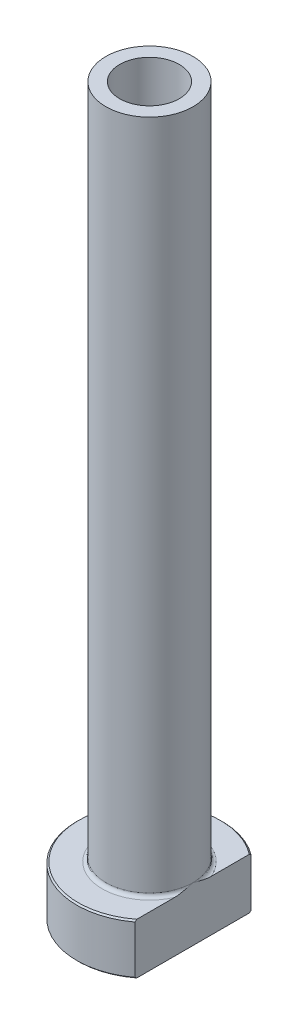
ISO-10303-21;
HEADER;
FILE_DESCRIPTION(('STEP AP214'),'2;1');
FILE_NAME('part.step','',(''),(''),'','','');
FILE_SCHEMA(('AUTOMOTIVE_DESIGN { 1 0 10303 214 1 1 1 1 }'));
ENDSEC;
DATA;
#1=APPLICATION_CONTEXT('core data for automotive mechanical design processes');
#2=APPLICATION_PROTOCOL_DEFINITION('international standard','automotive_design',2000,#1);
#3=PRODUCT_CONTEXT('',#1,'mechanical');
#4=PRODUCT('Part','Part','',(#3));
#5=PRODUCT_RELATED_PRODUCT_CATEGORY('part','',(#4));
#6=PRODUCT_DEFINITION_FORMATION('','',#4);
#7=PRODUCT_DEFINITION_CONTEXT('part definition',#1,'design');
#8=PRODUCT_DEFINITION('design','',#6,#7);
#9=PRODUCT_DEFINITION_SHAPE('','',#8);
#10=(LENGTH_UNIT() NAMED_UNIT(*) SI_UNIT(.MILLI.,.METRE.));
#11=(NAMED_UNIT(*) PLANE_ANGLE_UNIT() SI_UNIT($,.RADIAN.));
#12=(NAMED_UNIT(*) SI_UNIT($,.STERADIAN.) SOLID_ANGLE_UNIT());
#13=UNCERTAINTY_MEASURE_WITH_UNIT(LENGTH_MEASURE(1.E-05),#10,'distance_accuracy_value','');
#14=(GEOMETRIC_REPRESENTATION_CONTEXT(3) GLOBAL_UNCERTAINTY_ASSIGNED_CONTEXT((#13)) GLOBAL_UNIT_ASSIGNED_CONTEXT((#10,
#11,#12)) REPRESENTATION_CONTEXT('',''));
#15=CARTESIAN_POINT('',(0.,0.,0.));
#16=DIRECTION('',(0.,0.,1.));
#17=DIRECTION('',(1.,0.,0.));
#18=AXIS2_PLACEMENT_3D('',#15,#16,#17);
#19=CARTESIAN_POINT('',(0.,92.1876809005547,0.));
#20=DIRECTION('',(0.,1.,0.));
#21=DIRECTION('',(0.,0.,1.));
#22=AXIS2_PLACEMENT_3D('',#19,#20,#21);
#23=CYLINDRICAL_SURFACE('',#22,4.09999999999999);
#24=CARTESIAN_POINT('',(0.,100.,0.));
#25=DIRECTION('',(0.,1.,0.));
#26=DIRECTION('',(0.,0.,1.));
#27=AXIS2_PLACEMENT_3D('',#24,#25,#26);
#28=CIRCLE('',#27,4.09999999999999);
#29=CARTESIAN_POINT('',(0.,100.,4.09999999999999));
#30=VERTEX_POINT('',#29);
#31=EDGE_CURVE('E167',#30,#30,#28,.T.);
#32=ORIENTED_EDGE('',*,*,#31,.T.);
#33=EDGE_LOOP('',(#32));
#34=FACE_BOUND('',#33,.T.);
#35=CARTESIAN_POINT('',(0.,55.,0.));
#36=DIRECTION('',(0.,1.,0.));
#37=DIRECTION('',(0.,0.,1.));
#38=AXIS2_PLACEMENT_3D('',#35,#36,#37);
#39=CIRCLE('',#38,4.09999999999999);
#40=CARTESIAN_POINT('',(0.,55.,4.09999999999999));
#41=VERTEX_POINT('',#40);
#42=EDGE_CURVE('E170',#41,#41,#39,.T.);
#43=ORIENTED_EDGE('',*,*,#42,.F.);
#44=EDGE_LOOP('',(#43));
#45=FACE_BOUND('',#44,.T.);
#46=ADVANCED_FACE('F32',(#34,#45),#23,.F.);
#47=CARTESIAN_POINT('',(-4.09999999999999,100.,0.));
#48=DIRECTION('',(0.,1.,0.));
#49=DIRECTION('',(0.,0.,1.));
#50=AXIS2_PLACEMENT_3D('',#47,#48,#49);
#51=PLANE('',#50);
#52=CARTESIAN_POINT('',(0.,100.,0.));
#53=DIRECTION('',(0.,1.,0.));
#54=DIRECTION('',(0.,0.,1.));
#55=AXIS2_PLACEMENT_3D('',#52,#53,#54);
#56=CIRCLE('',#55,6.);
#57=CARTESIAN_POINT('',(0.,100.,6.));
#58=VERTEX_POINT('',#57);
#59=EDGE_CURVE('E174',#58,#58,#56,.T.);
#60=ORIENTED_EDGE('',*,*,#59,.T.);
#61=EDGE_LOOP('',(#60));
#62=FACE_BOUND('',#61,.T.);
#63=ORIENTED_EDGE('',*,*,#31,.F.);
#64=EDGE_LOOP('',(#63));
#65=FACE_BOUND('',#64,.T.);
#66=ADVANCED_FACE('F157',(#62,#65),#51,.T.);
#67=CARTESIAN_POINT('',(0.,92.1876809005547,0.));
#68=DIRECTION('',(0.,1.,0.));
#69=DIRECTION('',(0.,0.,1.));
#70=AXIS2_PLACEMENT_3D('',#67,#68,#69);
#71=CYLINDRICAL_SURFACE('',#70,6.);
#72=CARTESIAN_POINT('',(0.,7.50000000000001,0.));
#73=DIRECTION('',(0.,1.,0.));
#74=DIRECTION('',(0.,0.,1.));
#75=AXIS2_PLACEMENT_3D('',#72,#73,#74);
#76=CIRCLE('',#75,6.);
#77=CARTESIAN_POINT('',(6.,7.50000000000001,0.));
#78=VERTEX_POINT('',#77);
#79=EDGE_CURVE('E180',#78,#78,#76,.T.);
#80=ORIENTED_EDGE('',*,*,#79,.T.);
#81=EDGE_LOOP('',(#80));
#82=FACE_BOUND('',#81,.T.);
#83=ORIENTED_EDGE('',*,*,#59,.F.);
#84=EDGE_LOOP('',(#83));
#85=FACE_BOUND('',#84,.T.);
#86=ADVANCED_FACE('F162',(#82,#85),#71,.T.);
#87=CARTESIAN_POINT('',(-5.99999999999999,7.,0.));
#88=DIRECTION('',(0.,1.,0.));
#89=DIRECTION('',(0.,0.,1.));
#90=AXIS2_PLACEMENT_3D('',#87,#88,#89);
#91=PLANE('',#90);
#92=DIRECTION('',(0.,0.,1.));
#93=VECTOR('',#92,1.);
#94=CARTESIAN_POINT('',(6.,7.,0.));
#95=LINE('',#94,#93);
#96=CARTESIAN_POINT('',(6.,7.,-7.7485482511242));
#97=VERTEX_POINT('',#96);
#98=CARTESIAN_POINT('',(6.,7.,-2.5));
#99=VERTEX_POINT('',#98);
#100=EDGE_CURVE('E54',#97,#99,#95,.T.);
#101=ORIENTED_EDGE('',*,*,#100,.F.);
#102=CARTESIAN_POINT('',(0.,7.,0.));
#103=DIRECTION('',(0.,1.,0.));
#104=DIRECTION('',(0.,0.,1.));
#105=AXIS2_PLACEMENT_3D('',#102,#103,#104);
#106=CIRCLE('',#105,9.79999999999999);
#107=CARTESIAN_POINT('',(5.99999999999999,7.,7.7485482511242));
#108=VERTEX_POINT('',#107);
#109=EDGE_CURVE('E186',#97,#108,#106,.T.);
#110=ORIENTED_EDGE('',*,*,#109,.T.);
#111=CARTESIAN_POINT('',(6.,7.,2.5));
#112=VERTEX_POINT('',#111);
#113=EDGE_CURVE('E134',#112,#108,#95,.T.);
#114=ORIENTED_EDGE('',*,*,#113,.F.);
#115=CARTESIAN_POINT('',(0.,7.,0.));
#116=DIRECTION('',(0.,1.,0.));
#117=DIRECTION('',(0.,0.,1.));
#118=AXIS2_PLACEMENT_3D('',#115,#116,#117);
#119=CIRCLE('',#118,6.5);
#120=EDGE_CURVE('E183',#112,#99,#119,.F.);
#121=ORIENTED_EDGE('',*,*,#120,.T.);
#122=EDGE_LOOP('',(#101,#110,#114,#121));
#123=FACE_BOUND('',#122,.T.);
#124=ADVANCED_FACE('F197',(#123),#91,.T.);
#125=CARTESIAN_POINT('',(0.,92.1876809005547,0.));
#126=DIRECTION('',(0.,1.,0.));
#127=DIRECTION('',(0.,0.,1.));
#128=AXIS2_PLACEMENT_3D('',#125,#126,#127);
#129=CYLINDRICAL_SURFACE('',#128,9.99999999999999);
#130=DIRECTION('',(0.,-1.,0.));
#131=VECTOR('',#130,1.);
#132=CARTESIAN_POINT('',(5.99999999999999,100.,7.99999999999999));
#133=LINE('',#132,#131);
#134=CARTESIAN_POINT('',(5.99999999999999,6.8,7.99999999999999));
#135=VERTEX_POINT('',#134);
#136=CARTESIAN_POINT('',(5.99999999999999,0.199999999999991,7.99999999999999));
#137=VERTEX_POINT('',#136);
#138=EDGE_CURVE('E82',#135,#137,#133,.T.);
#139=ORIENTED_EDGE('',*,*,#138,.F.);
#140=CARTESIAN_POINT('',(0.,6.8,0.));
#141=DIRECTION('',(0.,1.,0.));
#142=DIRECTION('',(0.,0.,1.));
#143=AXIS2_PLACEMENT_3D('',#140,#141,#142);
#144=CIRCLE('',#143,9.99999999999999);
#145=CARTESIAN_POINT('',(6.,6.8,-7.99999999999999));
#146=VERTEX_POINT('',#145);
#147=EDGE_CURVE('E95',#135,#146,#144,.F.);
#148=ORIENTED_EDGE('',*,*,#147,.T.);
#149=DIRECTION('',(0.,-1.,0.));
#150=VECTOR('',#149,1.);
#151=CARTESIAN_POINT('',(6.,100.,-7.99999999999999));
#152=LINE('',#151,#150);
#153=CARTESIAN_POINT('',(6.,0.199999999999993,-7.99999999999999));
#154=VERTEX_POINT('',#153);
#155=EDGE_CURVE('E192',#146,#154,#152,.T.);
#156=ORIENTED_EDGE('',*,*,#155,.T.);
#157=CARTESIAN_POINT('',(0.,0.199999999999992,0.));
#158=DIRECTION('',(0.,-1.,0.));
#159=DIRECTION('',(0.,0.,-1.));
#160=AXIS2_PLACEMENT_3D('',#157,#158,#159);
#161=CIRCLE('',#160,9.99999999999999);
#162=EDGE_CURVE('E98',#154,#137,#161,.F.);
#163=ORIENTED_EDGE('',*,*,#162,.T.);
#164=EDGE_LOOP('',(#139,#148,#156,#163));
#165=FACE_BOUND('',#164,.T.);
#166=ADVANCED_FACE('F190',(#165),#129,.T.);
#167=CARTESIAN_POINT('',(-9.99999999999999,0.,0.));
#168=DIRECTION('',(0.,-1.,0.));
#169=DIRECTION('',(0.,0.,-1.));
#170=AXIS2_PLACEMENT_3D('',#167,#168,#169);
#171=PLANE('',#170);
#172=CARTESIAN_POINT('',(0.,0.,0.));
#173=DIRECTION('',(0.,-1.,0.));
#174=DIRECTION('',(0.,0.,-1.));
#175=AXIS2_PLACEMENT_3D('',#172,#173,#174);
#176=CIRCLE('',#175,4.84999999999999);
#177=CARTESIAN_POINT('',(0.,0.,-4.84999999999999));
#178=VERTEX_POINT('',#177);
#179=EDGE_CURVE('E40',#178,#178,#176,.F.);
#180=ORIENTED_EDGE('',*,*,#179,.T.);
#181=EDGE_LOOP('',(#180));
#182=FACE_BOUND('',#181,.T.);
#183=DIRECTION('',(0.,0.,-1.));
#184=VECTOR('',#183,1.);
#185=CARTESIAN_POINT('',(5.99999999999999,0.,7.99999999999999));
#186=LINE('',#185,#184);
#187=CARTESIAN_POINT('',(5.99999999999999,0.,7.7485482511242));
#188=VERTEX_POINT('',#187);
#189=CARTESIAN_POINT('',(6.,0.,-7.7485482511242));
#190=VERTEX_POINT('',#189);
#191=EDGE_CURVE('E47',#188,#190,#186,.T.);
#192=ORIENTED_EDGE('',*,*,#191,.F.);
#193=CARTESIAN_POINT('',(0.,0.,0.));
#194=DIRECTION('',(0.,-1.,0.));
#195=DIRECTION('',(0.,0.,-1.));
#196=AXIS2_PLACEMENT_3D('',#193,#194,#195);
#197=CIRCLE('',#196,9.79999999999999);
#198=EDGE_CURVE('E92',#188,#190,#197,.T.);
#199=ORIENTED_EDGE('',*,*,#198,.T.);
#200=EDGE_LOOP('',(#192,#199));
#201=FACE_BOUND('',#200,.T.);
#202=ADVANCED_FACE('F91',(#182,#201),#171,.T.);
#203=CARTESIAN_POINT('',(0.,92.1876809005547,0.));
#204=DIRECTION('',(0.,1.,0.));
#205=DIRECTION('',(0.,0.,1.));
#206=AXIS2_PLACEMENT_3D('',#203,#204,#205);
#207=CYLINDRICAL_SURFACE('',#206,4.34999999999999);
#208=CARTESIAN_POINT('',(0.,0.5,0.));
#209=DIRECTION('',(0.,-1.,0.));
#210=DIRECTION('',(0.,0.,-1.));
#211=AXIS2_PLACEMENT_3D('',#208,#209,#210);
#212=CIRCLE('',#211,4.34999999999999);
#213=CARTESIAN_POINT('',(0.,0.5,-4.34999999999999));
#214=VERTEX_POINT('',#213);
#215=EDGE_CURVE('E11',#214,#214,#212,.T.);
#216=ORIENTED_EDGE('',*,*,#215,.T.);
#217=EDGE_LOOP('',(#216));
#218=FACE_BOUND('',#217,.T.);
#219=CARTESIAN_POINT('',(0.,43.,0.));
#220=DIRECTION('',(0.,1.,0.));
#221=DIRECTION('',(0.,0.,1.));
#222=AXIS2_PLACEMENT_3D('',#219,#220,#221);
#223=CIRCLE('',#222,4.35);
#224=CARTESIAN_POINT('',(0.,43.,4.35));
#225=VERTEX_POINT('',#224);
#226=EDGE_CURVE('E172',#225,#225,#223,.T.);
#227=ORIENTED_EDGE('',*,*,#226,.T.);
#228=EDGE_LOOP('',(#227));
#229=FACE_BOUND('',#228,.T.);
#230=ADVANCED_FACE('F215',(#218,#229),#207,.F.);
#231=CARTESIAN_POINT('',(0.,43.,0.));
#232=DIRECTION('',(0.,-1.,0.));
#233=DIRECTION('',(0.,0.,-1.));
#234=AXIS2_PLACEMENT_3D('',#231,#232,#233);
#235=CONICAL_SURFACE('',#234,4.35,0.0208303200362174);
#236=ORIENTED_EDGE('',*,*,#42,.T.);
#237=EDGE_LOOP('',(#236));
#238=FACE_BOUND('',#237,.T.);
#239=ORIENTED_EDGE('',*,*,#226,.F.);
#240=EDGE_LOOP('',(#239));
#241=FACE_BOUND('',#240,.T.);
#242=ADVANCED_FACE('F111',(#238,#241),#235,.F.);
#243=CARTESIAN_POINT('',(0.,7.50000000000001,0.));
#244=DIRECTION('',(0.,1.,0.));
#245=DIRECTION('',(0.,0.,1.));
#246=AXIS2_PLACEMENT_3D('',#243,#244,#245);
#247=TOROIDAL_SURFACE('',#246,6.5,0.5);
#248=ORIENTED_EDGE('',*,*,#120,.F.);
#249=CARTESIAN_POINT('',(6.,7.50000000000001,0.));
#250=CARTESIAN_POINT('',(6.,7.5000008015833,6.70298548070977E-11));
#251=CARTESIAN_POINT('',(5.99999999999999,7.50000160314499,2.62462560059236E-07));
#252=CARTESIAN_POINT('',(5.99999999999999,7.50000311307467,1.01907165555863E-06));
#253=CARTESIAN_POINT('',(5.99999999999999,7.50000381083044,1.52837902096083E-06));
#254=CARTESIAN_POINT('',(5.99999999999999,7.50000523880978,2.74467576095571E-06));
#255=CARTESIAN_POINT('',(5.99999999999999,7.50000595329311,3.47066680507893E-06));
#256=CARTESIAN_POINT('',(5.99999999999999,7.50000725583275,4.99336131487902E-06));
#257=CARTESIAN_POINT('',(6.,7.50000784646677,5.788000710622E-06));
#258=CARTESIAN_POINT('',(6.,7.50000997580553,8.79661507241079E-06));
#259=CARTESIAN_POINT('',(5.99999999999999,7.50001139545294,1.10980663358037E-05));
#260=CARTESIAN_POINT('',(5.99999999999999,7.50001378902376,1.57116083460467E-05));
#261=CARTESIAN_POINT('',(6.,7.50001478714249,1.80117431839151E-05));
#262=CARTESIAN_POINT('',(6.,7.50001885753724,2.75423821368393E-05));
#263=CARTESIAN_POINT('',(6.,7.50002181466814,3.48285059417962E-05));
#264=CARTESIAN_POINT('',(6.,7.50002628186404,4.87408373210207E-05));
#265=CARTESIAN_POINT('',(6.,7.50002793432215,5.53214359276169E-05));
#266=CARTESIAN_POINT('',(6.,7.50003978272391,0.000103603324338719));
#267=CARTESIAN_POINT('',(6.,7.5000485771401,0.000145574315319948));
#268=CARTESIAN_POINT('',(5.99999999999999,7.50008704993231,0.000310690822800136));
#269=CARTESIAN_POINT('',(6.,7.5001239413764,0.000432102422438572));
#270=CARTESIAN_POINT('',(6.,7.5002668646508,0.000911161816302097));
#271=CARTESIAN_POINT('',(6.,7.50036807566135,0.00126981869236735));
#272=CARTESIAN_POINT('',(5.99999999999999,7.50077195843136,0.00268961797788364));
#273=CARTESIAN_POINT('',(5.99999999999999,7.5010805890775,0.00374948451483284));
#274=CARTESIAN_POINT('',(6.,7.50236320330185,0.00816658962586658));
#275=CARTESIAN_POINT('',(6.,7.50332976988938,0.0115254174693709));
#276=CARTESIAN_POINT('',(5.99999999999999,7.51709821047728,0.0593544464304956));
#277=CARTESIAN_POINT('',(5.99999999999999,7.52995465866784,0.103813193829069));
#278=CARTESIAN_POINT('',(6.,7.55506029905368,0.190977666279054));
#279=CARTESIAN_POINT('',(6.,7.56731321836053,0.233682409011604));
#280=CARTESIAN_POINT('',(5.99999999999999,7.59325665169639,0.324512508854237));
#281=CARTESIAN_POINT('',(6.,7.60693346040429,0.372641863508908));
#282=CARTESIAN_POINT('',(6.,7.6342203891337,0.469489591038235));
#283=CARTESIAN_POINT('',(6.,7.64782813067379,0.518208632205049));
#284=CARTESIAN_POINT('',(6.,7.68043734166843,0.63633850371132));
#285=CARTESIAN_POINT('',(6.,7.69928754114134,0.705791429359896));
#286=CARTESIAN_POINT('',(6.,7.73566887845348,0.843102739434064));
#287=CARTESIAN_POINT('',(6.,7.75322160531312,0.910955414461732));
#288=CARTESIAN_POINT('',(6.,7.80024878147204,1.09857433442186));
#289=CARTESIAN_POINT('',(6.,7.82864900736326,1.21861610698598));
#290=CARTESIAN_POINT('',(6.,7.88105633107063,1.46081534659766));
#291=CARTESIAN_POINT('',(6.,7.90502088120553,1.58298212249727));
#292=CARTESIAN_POINT('',(6.,7.94810499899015,1.83866408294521));
#293=CARTESIAN_POINT('',(6.,7.96665856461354,1.97228081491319));
#294=CARTESIAN_POINT('',(6.,7.98621697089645,2.17329578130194));
#295=CARTESIAN_POINT('',(6.,7.99135613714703,2.24029152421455));
#296=CARTESIAN_POINT('',(6.,7.99832928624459,2.37444824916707));
#297=CARTESIAN_POINT('',(6.,8.00016429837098,2.44160917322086));
#298=CARTESIAN_POINT('',(6.,7.99984674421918,2.56298631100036));
#299=CARTESIAN_POINT('',(6.,7.99839439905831,2.61720324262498));
#300=CARTESIAN_POINT('',(6.,7.99236557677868,2.72552036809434));
#301=CARTESIAN_POINT('',(6.,7.98778645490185,2.77962042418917));
#302=CARTESIAN_POINT('',(6.,7.97492915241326,2.88664710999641));
#303=CARTESIAN_POINT('',(6.,7.96670262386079,2.93957965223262));
#304=CARTESIAN_POINT('',(6.,7.94570253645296,3.04448333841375));
#305=CARTESIAN_POINT('',(6.,7.93293488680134,3.09645563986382));
#306=CARTESIAN_POINT('',(6.,7.90135968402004,3.19943606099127));
#307=CARTESIAN_POINT('',(6.,7.8824717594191,3.25042120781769));
#308=CARTESIAN_POINT('',(6.,7.84818685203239,3.32403783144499));
#309=CARTESIAN_POINT('',(6.,7.83579052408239,3.34806431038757));
#310=CARTESIAN_POINT('',(6.,7.80866016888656,3.39474488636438));
#311=CARTESIAN_POINT('',(6.,7.7939296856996,3.41740099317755));
#312=CARTESIAN_POINT('',(6.,7.76577135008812,3.45524173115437));
#313=CARTESIAN_POINT('',(6.,7.75294719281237,3.47087266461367));
#314=CARTESIAN_POINT('',(6.,7.72556313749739,3.50058040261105));
#315=CARTESIAN_POINT('',(6.,7.71100204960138,3.51465612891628));
#316=CARTESIAN_POINT('',(6.,7.67984897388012,3.54077006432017));
#317=CARTESIAN_POINT('',(6.,7.66323651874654,3.55278430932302));
#318=CARTESIAN_POINT('',(6.,7.62815222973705,3.57370259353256));
#319=CARTESIAN_POINT('',(6.,7.60968501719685,3.5826141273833));
#320=CARTESIAN_POINT('',(6.,7.57639898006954,3.5945465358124));
#321=CARTESIAN_POINT('',(6.,7.56191673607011,3.59850385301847));
#322=CARTESIAN_POINT('',(6.,7.5324922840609,3.60392336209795));
#323=CARTESIAN_POINT('',(6.,7.51755044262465,3.6053874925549));
#324=CARTESIAN_POINT('',(6.,7.48761833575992,3.60568912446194));
#325=CARTESIAN_POINT('',(6.,7.47262803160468,3.6045228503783));
#326=CARTESIAN_POINT('',(6.,7.44306278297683,3.59966500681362));
#327=CARTESIAN_POINT('',(6.,7.42848812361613,3.59597174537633));
#328=CARTESIAN_POINT('',(6.,7.39702156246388,3.58531109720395));
#329=CARTESIAN_POINT('',(6.,7.38031267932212,3.57780732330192));
#330=CARTESIAN_POINT('',(6.,7.34834450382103,3.56018434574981));
#331=CARTESIAN_POINT('',(6.,7.33308764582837,3.55006085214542));
#332=CARTESIAN_POINT('',(6.,7.2971530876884,3.52252389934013));
#333=CARTESIAN_POINT('',(6.,7.27737832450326,3.50394102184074));
#334=CARTESIAN_POINT('',(6.,7.24088410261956,3.46399503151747));
#335=CARTESIAN_POINT('',(6.,7.22417302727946,3.44262455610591));
#336=CARTESIAN_POINT('',(6.,7.18148338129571,3.38088102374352));
#337=CARTESIAN_POINT('',(6.,7.15831783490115,3.3385812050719));
#338=CARTESIAN_POINT('',(6.,7.11822747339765,3.25128083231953));
#339=CARTESIAN_POINT('',(6.,7.10130560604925,3.20627901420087));
#340=CARTESIAN_POINT('',(6.,7.07193388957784,3.11375892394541));
#341=CARTESIAN_POINT('',(6.,7.05959256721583,3.06620687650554));
#342=CARTESIAN_POINT('',(6.,7.03888782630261,2.97022063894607));
#343=CARTESIAN_POINT('',(6.,7.03052890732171,2.92178551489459));
#344=CARTESIAN_POINT('',(6.,7.01697563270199,2.82374574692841));
#345=CARTESIAN_POINT('',(6.,7.0118306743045,2.77413446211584));
#346=CARTESIAN_POINT('',(6.,7.00435015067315,2.67475263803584));
#347=CARTESIAN_POINT('',(6.,7.00201229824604,2.62498226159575));
#348=CARTESIAN_POINT('',(6.,6.99897190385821,2.49377014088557));
#349=CARTESIAN_POINT('',(6.,7.00025005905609,2.41228296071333));
#350=CARTESIAN_POINT('',(6.,7.00775652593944,2.24952135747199));
#351=CARTESIAN_POINT('',(6.,7.01398784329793,2.16824709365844));
#352=CARTESIAN_POINT('',(6.,7.03045087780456,2.00575531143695));
#353=CARTESIAN_POINT('',(6.,7.04070001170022,1.92453960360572));
#354=CARTESIAN_POINT('',(6.,7.06442774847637,1.76257601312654));
#355=CARTESIAN_POINT('',(6.,7.07790697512,1.68182822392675));
#356=CARTESIAN_POINT('',(6.,7.11973611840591,1.4539431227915));
#357=CARTESIAN_POINT('',(6.,7.15113840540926,1.30736987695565));
#358=CARTESIAN_POINT('',(6.,7.21927147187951,1.01717316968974));
#359=CARTESIAN_POINT('',(6.,7.25594155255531,0.873534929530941));
#360=CARTESIAN_POINT('',(6.,7.30765759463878,0.680321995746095));
#361=CARTESIAN_POINT('',(6.,7.32124979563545,0.630351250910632));
#362=CARTESIAN_POINT('',(6.,7.34913735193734,0.529103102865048));
#363=CARTESIAN_POINT('',(6.,7.3634417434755,0.47782818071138));
#364=CARTESIAN_POINT('',(6.,7.38809313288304,0.390268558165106));
#365=CARTESIAN_POINT('',(5.99999999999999,7.39837954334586,0.353966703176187));
#366=CARTESIAN_POINT('',(6.,7.4189344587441,0.281778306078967));
#367=CARTESIAN_POINT('',(6.,7.42920197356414,0.245891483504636));
#368=CARTESIAN_POINT('',(5.99999999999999,7.44864004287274,0.178137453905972));
#369=CARTESIAN_POINT('',(5.99999999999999,7.45780513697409,0.146268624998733));
#370=CARTESIAN_POINT('',(6.,7.47656016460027,0.0812304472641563));
#371=CARTESIAN_POINT('',(6.00000000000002,7.48615204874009,0.0480615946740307));
#372=CARTESIAN_POINT('',(5.99999999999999,7.49666961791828,0.0115277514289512));
#373=CARTESIAN_POINT('',(5.99999999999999,7.49763547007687,0.0081712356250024));
#374=CARTESIAN_POINT('',(6.,7.49891791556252,0.00375466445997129));
#375=CARTESIAN_POINT('',(6.,7.49922706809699,0.00269301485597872));
#376=CARTESIAN_POINT('',(5.99999999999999,7.4996315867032,0.00127098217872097));
#377=CARTESIAN_POINT('',(5.99999999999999,7.49973292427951,0.000911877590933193));
#378=CARTESIAN_POINT('',(6.,7.49987600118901,0.000432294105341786));
#379=CARTESIAN_POINT('',(6.,7.4999129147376,0.000310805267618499));
#380=CARTESIAN_POINT('',(5.99999999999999,7.49995140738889,0.000145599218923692));
#381=CARTESIAN_POINT('',(5.99999999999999,7.49996020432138,0.000103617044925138));
#382=CARTESIAN_POINT('',(6.,7.49997205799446,5.53238196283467E-05));
#383=CARTESIAN_POINT('',(6.,7.49997371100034,4.87425669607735E-05));
#384=CARTESIAN_POINT('',(6.,7.49997817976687,3.48289234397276E-05));
#385=CARTESIAN_POINT('',(6.,7.49998113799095,2.75421758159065E-05));
#386=CARTESIAN_POINT('',(6.,7.499985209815,1.80109000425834E-05));
#387=CARTESIAN_POINT('',(6.,7.4999862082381,1.57107160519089E-05));
#388=CARTESIAN_POINT('',(6.,7.49998860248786,1.10971285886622E-05));
#389=CARTESIAN_POINT('',(6.,7.49999002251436,8.79568654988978E-06));
#390=CARTESIAN_POINT('',(6.,7.49999215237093,5.78714699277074E-06));
#391=CARTESIAN_POINT('',(5.99999999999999,7.49999274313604,4.99254349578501E-06));
#392=CARTESIAN_POINT('',(5.99999999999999,7.49999404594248,3.46994443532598E-06));
#393=CARTESIAN_POINT('',(5.99999999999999,7.49999476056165,2.74401360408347E-06));
#394=CARTESIAN_POINT('',(6.,7.49999618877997,1.52785976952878E-06));
#395=CARTESIAN_POINT('',(6.,7.49999688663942,1.01863028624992E-06));
#396=CARTESIAN_POINT('',(6.,7.49999839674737,2.62215535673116E-07));
#397=CARTESIAN_POINT('',(6.,7.49999919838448,-6.70312491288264E-11));
#398=CARTESIAN_POINT('',(6.,7.50000000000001,0.));
#399=B_SPLINE_CURVE_WITH_KNOTS('',3,(#249,#250,#251,#252,#253,#254,#255,#256,#257,#258,#259,
#260,#261,#262,#263,#264,#265,#266,#267,#268,#269,#270,#271,#272,#273,#274,#275,#276,#277,#278,
#279,#280,#281,#282,#283,#284,#285,#286,#287,#288,#289,#290,#291,#292,#293,#294,#295,#296,#297,
#298,#299,#300,#301,#302,#303,#304,#305,#306,#307,#308,#309,#310,#311,#312,#313,#314,#315,#316,
#317,#318,#319,#320,#321,#322,#323,#324,#325,#326,#327,#328,#329,#330,#331,#332,#333,#334,#335,
#336,#337,#338,#339,#340,#341,#342,#343,#344,#345,#346,#347,#348,#349,#350,#351,#352,#353,#354,
#355,#356,#357,#358,#359,#360,#361,#362,#363,#364,#365,#366,#367,#368,#369,#370,#371,#372,#373,
#374,#375,#376,#377,#378,#379,#380,#381,#382,#383,#384,#385,#386,#387,#388,#389,#390,#391,#392,
#393,#394,#395,#396,#397,#398),.UNSPECIFIED.,.T.,.F.,(4,2,2,2,2,2,2,2,2,2,2,2,2,2,2,2,2,2,2,2,2,
2,2,2,2,2,2,2,2,2,2,2,2,2,2,2,2,2,2,2,2,2,2,2,2,2,2,2,2,2,2,2,2,2,2,2,2,2,2,2,2,2,2,2,2,2,2,2,2,
2,2,2,2,2,4),(0.,2.41533062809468E-06,5.00162171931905E-06,8.04116460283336E-06,
1.10092376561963E-05,1.90889814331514E-05,2.66047466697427E-05,5.01454169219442E-05,
7.04740142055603E-05,0.000199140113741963,0.000579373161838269,0.00169781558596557,
0.00500893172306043,0.0154949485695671,0.154330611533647,0.287615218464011,0.437719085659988,
0.589470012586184,0.805361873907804,1.01561737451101,1.3856140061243,1.75899405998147,
2.16331287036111,2.36482907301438,2.56628249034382,2.7289186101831,2.89169246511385,
3.052231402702,3.21256219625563,3.37509011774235,3.4560997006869,3.5369874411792,
3.59753760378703,3.65812948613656,3.71938396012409,3.78048942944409,3.82533702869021,
3.87014974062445,3.91502681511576,3.95993396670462,4.01458097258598,4.06931803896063,
4.1502680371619,4.23143634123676,4.37530581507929,4.51924312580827,4.66640085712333,
4.81372446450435,4.96325999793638,5.11267360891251,5.35695170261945,5.60137814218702,
5.84687607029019,6.0924214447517,6.54191534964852,6.98659302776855,7.14195169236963,
7.30164895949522,7.41484221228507,7.52682205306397,7.62630458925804,7.72988447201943,
7.74036324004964,7.7436799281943,7.74479976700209,7.74518024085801,7.74530894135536,
7.74532927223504,7.74535281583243,7.74536033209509,7.74536841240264,7.74537138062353,
7.74537442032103,7.74537700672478,7.74537942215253),.UNSPECIFIED.);
#400=EDGE_CURVE('E126',#112,#78,#399,.T.);
#401=ORIENTED_EDGE('',*,*,#400,.T.);
#402=ORIENTED_EDGE('',*,*,#79,.F.);
#403=CARTESIAN_POINT('',(6.,7.50000000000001,0.));
#404=CARTESIAN_POINT('',(6.,7.49999919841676,-6.70430860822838E-11));
#405=CARTESIAN_POINT('',(6.,7.49999839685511,-2.62462595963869E-07));
#406=CARTESIAN_POINT('',(6.,7.49999688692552,-1.01907172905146E-06));
#407=CARTESIAN_POINT('',(6.,7.4999961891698,-1.52837911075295E-06));
#408=CARTESIAN_POINT('',(6.,7.49999476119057,-2.74467588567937E-06));
#409=CARTESIAN_POINT('',(6.,7.49999404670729,-3.47066694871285E-06));
#410=CARTESIAN_POINT('',(6.,7.49999274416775,-4.99336148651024E-06));
#411=CARTESIAN_POINT('',(6.,7.49999215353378,-5.78800089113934E-06));
#412=CARTESIAN_POINT('',(6.,7.4999900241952,-8.79661531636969E-06));
#413=CARTESIAN_POINT('',(6.,7.49998860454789,-1.1098066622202E-05));
#414=CARTESIAN_POINT('',(6.,7.4999862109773,-1.57116086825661E-05));
#415=CARTESIAN_POINT('',(6.,7.49998521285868,-1.80117435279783E-05));
#416=CARTESIAN_POINT('',(5.99999999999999,7.49998114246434,-2.75423826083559E-05));
#417=CARTESIAN_POINT('',(5.99999999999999,7.4999781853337,-3.48285065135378E-05));
#418=CARTESIAN_POINT('',(5.99999999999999,7.49997371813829,-4.87408379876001E-05));
#419=CARTESIAN_POINT('',(6.,7.49997206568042,-5.53214365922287E-05));
#420=CARTESIAN_POINT('',(6.,7.49996021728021,-0.000103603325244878));
#421=CARTESIAN_POINT('',(6.,7.49995142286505,-0.000145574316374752));
#422=CARTESIAN_POINT('',(5.99999999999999,7.49991295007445,-0.000310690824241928));
#423=CARTESIAN_POINT('',(5.99999999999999,7.49987605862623,-0.000432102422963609));
#424=CARTESIAN_POINT('',(6.,7.49973313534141,-0.000911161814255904));
#425=CARTESIAN_POINT('',(6.,7.49963192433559,-0.00126981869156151));
#426=CARTESIAN_POINT('',(5.99999999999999,7.49922804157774,-0.00268961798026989));
#427=CARTESIAN_POINT('',(5.99999999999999,7.49891941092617,-0.00374948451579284));
#428=CARTESIAN_POINT('',(6.,7.49763679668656,-0.00816658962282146));
#429=CARTESIAN_POINT('',(6.,7.49667023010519,-0.0115254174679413));
#430=CARTESIAN_POINT('',(5.99999999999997,7.48290178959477,-0.0593544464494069));
#431=CARTESIAN_POINT('',(5.99999999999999,7.47004534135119,-0.10381319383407));
#432=CARTESIAN_POINT('',(6.,7.44493970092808,-0.190977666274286));
#433=CARTESIAN_POINT('',(6.,7.43268678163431,-0.233682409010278));
#434=CARTESIAN_POINT('',(5.99999999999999,7.40674334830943,-0.324512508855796));
#435=CARTESIAN_POINT('',(5.99999999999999,7.3930665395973,-0.372641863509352));
#436=CARTESIAN_POINT('',(6.,7.3657796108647,-0.469489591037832));
#437=CARTESIAN_POINT('',(6.,7.35217186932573,-0.51820863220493));
#438=CARTESIAN_POINT('',(6.,7.31956265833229,-0.636338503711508));
#439=CARTESIAN_POINT('',(6.,7.30071245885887,-0.705791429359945));
#440=CARTESIAN_POINT('',(6.,7.26433112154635,-0.843102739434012));
#441=CARTESIAN_POINT('',(6.,7.24677839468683,-0.910955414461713));
#442=CARTESIAN_POINT('',(6.,7.19975121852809,-1.09857433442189));
#443=CARTESIAN_POINT('',(6.,7.17135099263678,-1.21861610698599));
#444=CARTESIAN_POINT('',(6.,7.11894366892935,-1.46081534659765));
#445=CARTESIAN_POINT('',(6.,7.09497911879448,-1.58298212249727));
#446=CARTESIAN_POINT('',(6.,7.05189500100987,-1.83866408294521));
#447=CARTESIAN_POINT('',(6.,7.03334143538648,-1.97228081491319));
#448=CARTESIAN_POINT('',(6.,7.01378302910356,-2.17329578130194));
#449=CARTESIAN_POINT('',(6.,7.00864386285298,-2.24029152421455));
#450=CARTESIAN_POINT('',(6.,7.00167071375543,-2.37444824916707));
#451=CARTESIAN_POINT('',(6.,6.99983570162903,-2.44160917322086));
#452=CARTESIAN_POINT('',(6.,7.00015325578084,-2.56298631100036));
#453=CARTESIAN_POINT('',(6.,7.0016056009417,-2.61720324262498));
#454=CARTESIAN_POINT('',(6.,7.00763442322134,-2.72552036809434));
#455=CARTESIAN_POINT('',(6.,7.01221354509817,-2.77962042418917));
#456=CARTESIAN_POINT('',(6.,7.02507084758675,-2.88664710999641));
#457=CARTESIAN_POINT('',(6.,7.03329737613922,-2.93957965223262));
#458=CARTESIAN_POINT('',(6.,7.05429746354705,-3.04448333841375));
#459=CARTESIAN_POINT('',(6.,7.06706511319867,-3.09645563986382));
#460=CARTESIAN_POINT('',(6.,7.09864031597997,-3.19943606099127));
#461=CARTESIAN_POINT('',(6.,7.11752824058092,-3.25042120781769));
#462=CARTESIAN_POINT('',(6.,7.15181314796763,-3.32403783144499));
#463=CARTESIAN_POINT('',(6.,7.16420947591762,-3.34806431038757));
#464=CARTESIAN_POINT('',(6.,7.19133983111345,-3.39474488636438));
#465=CARTESIAN_POINT('',(6.,7.20607031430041,-3.41740099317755));
#466=CARTESIAN_POINT('',(6.,7.2342286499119,-3.45524173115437));
#467=CARTESIAN_POINT('',(6.,7.24705280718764,-3.47087266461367));
#468=CARTESIAN_POINT('',(6.,7.27443686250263,-3.50058040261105));
#469=CARTESIAN_POINT('',(6.,7.28899795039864,-3.51465612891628));
#470=CARTESIAN_POINT('',(6.,7.32015102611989,-3.54077006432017));
#471=CARTESIAN_POINT('',(6.,7.33676348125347,-3.55278430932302));
#472=CARTESIAN_POINT('',(6.,7.37184777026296,-3.57370259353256));
#473=CARTESIAN_POINT('',(6.,7.39031498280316,-3.5826141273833));
#474=CARTESIAN_POINT('',(6.,7.42360101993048,-3.5945465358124));
#475=CARTESIAN_POINT('',(6.,7.4380832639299,-3.59850385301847));
#476=CARTESIAN_POINT('',(6.,7.46750771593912,-3.60392336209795));
#477=CARTESIAN_POINT('',(6.,7.48244955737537,-3.60538749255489));
#478=CARTESIAN_POINT('',(6.,7.5123816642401,-3.60568912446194));
#479=CARTESIAN_POINT('',(6.,7.52737196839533,-3.6045228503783));
#480=CARTESIAN_POINT('',(6.,7.55693721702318,-3.59966500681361));
#481=CARTESIAN_POINT('',(6.,7.57151187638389,-3.59597174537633));
#482=CARTESIAN_POINT('',(6.,7.60297843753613,-3.58531109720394));
#483=CARTESIAN_POINT('',(6.,7.61968732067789,-3.57780732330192));
#484=CARTESIAN_POINT('',(6.,7.65165549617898,-3.56018434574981));
#485=CARTESIAN_POINT('',(6.,7.66691235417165,-3.55006085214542));
#486=CARTESIAN_POINT('',(6.,7.70284691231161,-3.52252389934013));
#487=CARTESIAN_POINT('',(6.,7.72262167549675,-3.50394102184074));
#488=CARTESIAN_POINT('',(6.,7.75911589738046,-3.46399503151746));
#489=CARTESIAN_POINT('',(6.,7.77582697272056,-3.44262455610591));
#490=CARTESIAN_POINT('',(6.,7.8185166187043,-3.38088102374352));
#491=CARTESIAN_POINT('',(6.,7.84168216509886,-3.3385812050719));
#492=CARTESIAN_POINT('',(6.,7.88177252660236,-3.25128083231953));
#493=CARTESIAN_POINT('',(6.,7.89869439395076,-3.20627901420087));
#494=CARTESIAN_POINT('',(6.,7.92806611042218,-3.11375892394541));
#495=CARTESIAN_POINT('',(6.,7.94040743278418,-3.06620687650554));
#496=CARTESIAN_POINT('',(6.,7.9611121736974,-2.97022063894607));
#497=CARTESIAN_POINT('',(6.,7.9694710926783,-2.9217855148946));
#498=CARTESIAN_POINT('',(6.,7.98302436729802,-2.82374574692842));
#499=CARTESIAN_POINT('',(6.,7.98816932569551,-2.77413446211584));
#500=CARTESIAN_POINT('',(6.,7.99564984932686,-2.67475263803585));
#501=CARTESIAN_POINT('',(6.,7.99798770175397,-2.62498226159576));
#502=CARTESIAN_POINT('',(6.,8.00102809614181,-2.49377014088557));
#503=CARTESIAN_POINT('',(6.,7.99974994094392,-2.41228296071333));
#504=CARTESIAN_POINT('',(6.,7.99224347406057,-2.24952135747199));
#505=CARTESIAN_POINT('',(6.,7.98601215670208,-2.16824709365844));
#506=CARTESIAN_POINT('',(6.,7.96954912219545,-2.00575531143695));
#507=CARTESIAN_POINT('',(6.,7.95929998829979,-1.92453960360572));
#508=CARTESIAN_POINT('',(6.,7.93557225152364,-1.76257601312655));
#509=CARTESIAN_POINT('',(6.,7.92209302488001,-1.68182822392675));
#510=CARTESIAN_POINT('',(6.,7.8802638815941,-1.45394312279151));
#511=CARTESIAN_POINT('',(6.,7.84886159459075,-1.30736987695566));
#512=CARTESIAN_POINT('',(6.,7.78072852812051,-1.01717316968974));
#513=CARTESIAN_POINT('',(6.,7.74405844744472,-0.873534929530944));
#514=CARTESIAN_POINT('',(6.,7.69234240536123,-0.6803219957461));
#515=CARTESIAN_POINT('',(6.,7.67875020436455,-0.630351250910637));
#516=CARTESIAN_POINT('',(6.,7.65086264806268,-0.529103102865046));
#517=CARTESIAN_POINT('',(6.,7.63655825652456,-0.477828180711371));
#518=CARTESIAN_POINT('',(6.,7.61190686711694,-0.390268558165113));
#519=CARTESIAN_POINT('',(6.,7.60162045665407,-0.35396670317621));
#520=CARTESIAN_POINT('',(5.99999999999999,7.581065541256,-0.281778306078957));
#521=CARTESIAN_POINT('',(5.99999999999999,7.57079802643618,-0.245891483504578));
#522=CARTESIAN_POINT('',(6.,7.55135995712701,-0.178137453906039));
#523=CARTESIAN_POINT('',(6.,7.54219486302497,-0.14626862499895));
#524=CARTESIAN_POINT('',(5.99999999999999,7.52343983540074,-0.0812304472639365));
#525=CARTESIAN_POINT('',(5.99999999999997,7.51384795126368,-0.0480615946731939));
#526=CARTESIAN_POINT('',(6.,7.50333038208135,-0.0115277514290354));
#527=CARTESIAN_POINT('',(6.,7.50236452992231,-0.00817123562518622));
#528=CARTESIAN_POINT('',(5.99999999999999,7.5010820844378,-0.0037546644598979));
#529=CARTESIAN_POINT('',(5.99999999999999,7.50077293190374,-0.00269301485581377));
#530=CARTESIAN_POINT('',(6.,7.50036841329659,-0.00127098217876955));
#531=CARTESIAN_POINT('',(6.,7.50026707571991,-0.000911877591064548));
#532=CARTESIAN_POINT('',(5.99999999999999,7.50012399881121,-0.000432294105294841));
#533=CARTESIAN_POINT('',(5.99999999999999,7.50008708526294,-0.000310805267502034));
#534=CARTESIAN_POINT('',(6.,7.50004859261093,-0.000145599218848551));
#535=CARTESIAN_POINT('',(6.,7.50003979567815,-0.00010361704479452));
#536=CARTESIAN_POINT('',(5.99999999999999,7.50002794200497,-5.53238194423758E-05));
#537=CARTESIAN_POINT('',(5.99999999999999,7.5000262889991,-4.87425668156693E-05));
#538=CARTESIAN_POINT('',(5.99999999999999,7.50002182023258,-3.48289233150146E-05));
#539=CARTESIAN_POINT('',(6.,7.5000188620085,-2.75421756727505E-05));
#540=CARTESIAN_POINT('',(6.,7.50001479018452,-1.80108998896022E-05));
#541=CARTESIAN_POINT('',(5.99999999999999,7.50001379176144,-1.57107159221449E-05));
#542=CARTESIAN_POINT('',(5.99999999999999,7.50001139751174,-1.10971284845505E-05));
#543=CARTESIAN_POINT('',(5.99999999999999,7.50000997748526,-8.79568644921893E-06));
#544=CARTESIAN_POINT('',(6.,7.50000784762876,-5.78714689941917E-06));
#545=CARTESIAN_POINT('',(6.,7.50000725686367,-4.99254341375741E-06));
#546=CARTESIAN_POINT('',(6.,7.50000595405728,-3.4699443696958E-06));
#547=CARTESIAN_POINT('',(6.,7.50000523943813,-2.7440135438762E-06));
#548=CARTESIAN_POINT('',(6.,7.50000381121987,-1.52785972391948E-06));
#549=CARTESIAN_POINT('',(6.,7.50000311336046,-1.0186302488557E-06));
#550=CARTESIAN_POINT('',(6.,7.50000160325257,-2.62215514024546E-07));
#551=CARTESIAN_POINT('',(6.,7.50000080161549,6.70470831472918E-11));
#552=CARTESIAN_POINT('',(6.,7.50000000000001,0.));
#553=B_SPLINE_CURVE_WITH_KNOTS('',3,(#403,#404,#405,#406,#407,#408,#409,#410,#411,#412,#413,
#414,#415,#416,#417,#418,#419,#420,#421,#422,#423,#424,#425,#426,#427,#428,#429,#430,#431,#432,
#433,#434,#435,#436,#437,#438,#439,#440,#441,#442,#443,#444,#445,#446,#447,#448,#449,#450,#451,
#452,#453,#454,#455,#456,#457,#458,#459,#460,#461,#462,#463,#464,#465,#466,#467,#468,#469,#470,
#471,#472,#473,#474,#475,#476,#477,#478,#479,#480,#481,#482,#483,#484,#485,#486,#487,#488,#489,
#490,#491,#492,#493,#494,#495,#496,#497,#498,#499,#500,#501,#502,#503,#504,#505,#506,#507,#508,
#509,#510,#511,#512,#513,#514,#515,#516,#517,#518,#519,#520,#521,#522,#523,#524,#525,#526,#527,
#528,#529,#530,#531,#532,#533,#534,#535,#536,#537,#538,#539,#540,#541,#542,#543,#544,#545,#546,
#547,#548,#549,#550,#551,#552),.UNSPECIFIED.,.T.,.F.,(4,2,2,2,2,2,2,2,2,2,2,2,2,2,2,2,2,2,2,2,2,
2,2,2,2,2,2,2,2,2,2,2,2,2,2,2,2,2,2,2,2,2,2,2,2,2,2,2,2,2,2,2,2,2,2,2,2,2,2,2,2,2,2,2,2,2,2,2,2,
2,2,2,2,2,4),(0.,2.41533051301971E-06,5.0016215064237E-06,8.04116432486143E-06,
1.10092373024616E-05,1.90889810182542E-05,2.66047461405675E-05,5.01454163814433E-05,
7.04740134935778E-05,0.000199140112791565,0.000579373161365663,0.00169781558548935,
0.00500893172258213,0.0154949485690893,0.154330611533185,0.287615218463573,0.437719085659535,
0.589470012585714,0.805361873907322,1.01561737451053,1.38561400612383,1.75899405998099,
2.16331287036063,2.3648290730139,2.56628249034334,2.72891861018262,2.89169246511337,
3.05223140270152,3.21256219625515,3.37509011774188,3.45609970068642,3.53698744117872,
3.59753760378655,3.65812948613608,3.71938396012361,3.78048942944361,3.82533702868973,
3.87014974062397,3.91502681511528,3.95993396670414,4.0145809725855,4.06931803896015,
4.15026803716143,4.23143634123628,4.37530581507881,4.51924312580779,4.66640085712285,
4.81372446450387,4.9632599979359,5.11267360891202,5.35695170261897,5.60137814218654,
5.84687607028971,6.09242144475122,6.54191534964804,6.98659302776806,7.14195169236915,
7.30164895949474,7.41484221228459,7.52682205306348,7.62630458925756,7.72988447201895,
7.74036324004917,7.74367992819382,7.74479976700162,7.74518024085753,7.74530894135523,
7.74532927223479,7.74535281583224,7.7453603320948,7.7453684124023,7.74537138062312,
7.74537442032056,7.74537700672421,7.74537942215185),.UNSPECIFIED.);
#554=EDGE_CURVE('E135',#78,#99,#553,.T.);
#555=ORIENTED_EDGE('',*,*,#554,.T.);
#556=EDGE_LOOP('',(#248,#401,#402,#555));
#557=FACE_BOUND('',#556,.T.);
#558=ADVANCED_FACE('F141',(#557),#247,.F.);
#559=CARTESIAN_POINT('',(0.,7.00000000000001,0.));
#560=DIRECTION('',(0.,-1.,0.));
#561=DIRECTION('',(0.,0.,-1.));
#562=AXIS2_PLACEMENT_3D('',#559,#560,#561);
#563=CONICAL_SURFACE('',#562,9.79999999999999,0.785398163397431);
#564=CARTESIAN_POINT('',(6.,-1.795522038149,-17.6009499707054));
#565=CARTESIAN_POINT('',(6.,-1.52401937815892,-17.3141017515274));
#566=CARTESIAN_POINT('',(6.,-1.25287676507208,-17.0269132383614));
#567=CARTESIAN_POINT('',(6.,-0.711434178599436,-16.4517398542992));
#568=CARTESIAN_POINT('',(6.,-0.441134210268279,-16.1637549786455));
#569=CARTESIAN_POINT('',(6.,0.36894074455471,-15.2977662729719));
#570=CARTESIAN_POINT('',(6.,0.907258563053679,-14.718395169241));
#571=CARTESIAN_POINT('',(6.,1.72215780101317,-13.8331216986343));
#572=CARTESIAN_POINT('',(6.,2.0007113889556,-13.5290344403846));
#573=CARTESIAN_POINT('',(6.,2.55603074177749,-12.9192325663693));
#574=CARTESIAN_POINT('',(6.,2.83279651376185,-12.6135179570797));
#575=CARTESIAN_POINT('',(6.,3.38385174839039,-12.0004608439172));
#576=CARTESIAN_POINT('',(6.,3.65814356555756,-11.6931204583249));
#577=CARTESIAN_POINT('',(6.,4.20403297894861,-11.0760595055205));
#578=CARTESIAN_POINT('',(6.,4.47563060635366,-10.7663389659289));
#579=CARTESIAN_POINT('',(6.,5.01505245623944,-10.1444038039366));
#580=CARTESIAN_POINT('',(6.,5.28288153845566,-9.83219340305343));
#581=CARTESIAN_POINT('',(6.,5.81422935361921,-9.20408822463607));
#582=CARTESIAN_POINT('',(6.,6.07774785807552,-8.88819325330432));
#583=CARTESIAN_POINT('',(6.,6.60003626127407,-8.25062578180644));
#584=CARTESIAN_POINT('',(6.,6.85878611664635,-7.92893682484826));
#585=CARTESIAN_POINT('',(6.,7.36859509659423,-7.27955943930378));
#586=CARTESIAN_POINT('',(6.,7.61965542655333,-6.95187196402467));
#587=CARTESIAN_POINT('',(6.,7.98576066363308,-6.45775713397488));
#588=CARTESIAN_POINT('',(6.,8.10486172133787,-6.29433436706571));
#589=CARTESIAN_POINT('',(6.,8.34000134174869,-5.9653036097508));
#590=CARTESIAN_POINT('',(6.,8.45604001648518,-5.79969569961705));
#591=CARTESIAN_POINT('',(6.,8.68455547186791,-5.4658267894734));
#592=CARTESIAN_POINT('',(6.,8.79702913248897,-5.29756364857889));
#593=CARTESIAN_POINT('',(6.,9.01753757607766,-4.95816178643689));
#594=CARTESIAN_POINT('',(6.,9.12557269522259,-4.78702328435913));
#595=CARTESIAN_POINT('',(6.,9.3356082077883,-4.44248614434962));
#596=CARTESIAN_POINT('',(6.,9.43764111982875,-4.26910741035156));
#597=CARTESIAN_POINT('',(6.,9.63518094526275,-3.91862113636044));
#598=CARTESIAN_POINT('',(6.,9.73068703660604,-3.74151313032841));
#599=CARTESIAN_POINT('',(6.,9.91348788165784,-3.38344678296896));
#600=CARTESIAN_POINT('',(6.,10.0007956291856,-3.20249511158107));
#601=CARTESIAN_POINT('',(6.,10.1654678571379,-2.83615347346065));
#602=CARTESIAN_POINT('',(6.,10.242836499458,-2.65076540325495));
#603=CARTESIAN_POINT('',(6.,10.3476493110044,-2.37476230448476));
#604=CARTESIAN_POINT('',(6.,10.3798377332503,-2.28593872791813));
#605=CARTESIAN_POINT('',(6.,10.4412613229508,-2.10727300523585));
#606=CARTESIAN_POINT('',(6.,10.470496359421,-2.01743081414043));
#607=CARTESIAN_POINT('',(6.,10.5533861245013,-1.74635894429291));
#608=CARTESIAN_POINT('',(6.,10.6022144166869,-1.56361273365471));
#609=CARTESIAN_POINT('',(6.,10.6846214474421,-1.19573724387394));
#610=CARTESIAN_POINT('',(6.,10.718282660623,-1.01062662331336));
#611=CARTESIAN_POINT('',(6.,10.7689812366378,-0.638123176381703));
#612=CARTESIAN_POINT('',(6.,10.7860205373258,-0.450730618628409));
#613=CARTESIAN_POINT('',(6.,10.8025183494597,-0.0738640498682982));
#614=CARTESIAN_POINT('',(6.,10.8018548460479,0.115615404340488));
#615=CARTESIAN_POINT('',(6.,10.7826880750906,0.493653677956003));
#616=CARTESIAN_POINT('',(6.,10.7641846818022,0.682212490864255));
#617=CARTESIAN_POINT('',(6.,10.710325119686,1.05776266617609));
#618=CARTESIAN_POINT('',(6.,10.6748911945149,1.24474270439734));
#619=CARTESIAN_POINT('',(6.,10.5890121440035,1.61520150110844));
#620=CARTESIAN_POINT('',(6.,10.5385638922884,1.79867952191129));
#621=CARTESIAN_POINT('',(6.,10.3911282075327,2.26914112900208));
#622=CARTESIAN_POINT('',(6.,10.2842782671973,2.55302531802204));
#623=CARTESIAN_POINT('',(6.,10.0463958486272,3.11045503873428));
#624=CARTESIAN_POINT('',(6.,9.91534345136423,3.38399182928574));
#625=CARTESIAN_POINT('',(6.,9.70492342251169,3.78859721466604));
#626=CARTESIAN_POINT('',(5.99999999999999,9.63209854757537,3.92313856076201));
#627=CARTESIAN_POINT('',(5.99999999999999,9.48259417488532,4.19006838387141));
#628=CARTESIAN_POINT('',(5.99999999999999,9.40591462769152,4.32245683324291));
#629=CARTESIAN_POINT('',(5.99999999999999,9.24930540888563,4.58520549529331));
#630=CARTESIAN_POINT('',(5.99999999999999,9.169377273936,4.71556662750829));
#631=CARTESIAN_POINT('',(5.99999999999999,9.00669783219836,4.9745035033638));
#632=CARTESIAN_POINT('',(5.99999999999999,8.92394663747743,5.10307931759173));
#633=CARTESIAN_POINT('',(5.99999999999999,8.64351229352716,5.52985219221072));
#634=CARTESIAN_POINT('',(5.99999999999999,8.44039926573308,5.8244859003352));
#635=CARTESIAN_POINT('',(5.99999999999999,8.0246071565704,6.4069492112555));
#636=CARTESIAN_POINT('',(5.99999999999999,7.81192597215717,6.69477729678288));
#637=CARTESIAN_POINT('',(5.99999999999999,7.37931497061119,7.26525171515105));
#638=CARTESIAN_POINT('',(5.99999999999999,7.1593799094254,7.54789405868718));
#639=CARTESIAN_POINT('',(5.99999999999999,6.71413940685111,8.10886295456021));
#640=CARTESIAN_POINT('',(5.99999999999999,6.48883440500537,8.38718985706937));
#641=CARTESIAN_POINT('',(5.99999999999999,6.03331036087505,8.94128328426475));
#642=CARTESIAN_POINT('',(5.99999999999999,5.80307787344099,9.21703873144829));
#643=CARTESIAN_POINT('',(5.99999999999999,5.3392797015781,9.76573512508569));
#644=CARTESIAN_POINT('',(5.99999999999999,5.1057139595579,10.0386760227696));
#645=CARTESIAN_POINT('',(5.99999999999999,4.63600560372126,10.5821276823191));
#646=CARTESIAN_POINT('',(5.99999999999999,4.39986411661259,10.8526394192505));
#647=CARTESIAN_POINT('',(5.99999999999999,3.92539621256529,11.3917411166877));
#648=CARTESIAN_POINT('',(5.99999999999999,3.6870697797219,11.6603310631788));
#649=CARTESIAN_POINT('',(5.99999999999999,3.01761185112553,12.4097238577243));
#650=CARTESIAN_POINT('',(5.99999999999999,2.58447471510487,12.8887346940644));
#651=CARTESIAN_POINT('',(5.99999999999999,1.71393239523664,13.8429570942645));
#652=CARTESIAN_POINT('',(5.99999999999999,1.27652670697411,14.3181681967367));
#653=CARTESIAN_POINT('',(5.99999999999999,0.401335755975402,15.2626172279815));
#654=CARTESIAN_POINT('',(5.99999999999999,-0.0364292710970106,15.7318739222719));
#655=CARTESIAN_POINT('',(5.99999999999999,-0.694863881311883,16.4340144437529));
#656=CARTESIAN_POINT('',(5.99999999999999,-0.914623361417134,16.6677530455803));
#657=CARTESIAN_POINT('',(5.99999999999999,-1.35468319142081,17.1347195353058));
#658=CARTESIAN_POINT('',(5.99999999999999,-1.57498354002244,17.3679474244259));
#659=CARTESIAN_POINT('',(5.99999999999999,-1.79552203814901,17.6009499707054));
#660=B_SPLINE_CURVE_WITH_KNOTS('',3,(#564,#565,#566,#567,#568,#569,#570,#571,#572,#573,#574,
#575,#576,#577,#578,#579,#580,#581,#582,#583,#584,#585,#586,#587,#588,#589,#590,#591,#592,#593,
#594,#595,#596,#597,#598,#599,#600,#601,#602,#603,#604,#605,#606,#607,#608,#609,#610,#611,#612,
#613,#614,#615,#616,#617,#618,#619,#620,#621,#622,#623,#624,#625,#626,#627,#628,#629,#630,#631,
#632,#633,#634,#635,#636,#637,#638,#639,#640,#641,#642,#643,#644,#645,#646,#647,#648,#649,#650,
#651,#652,#653,#654,#655,#656,#657,#658,#659),.UNSPECIFIED.,.F.,.F.,(4,2,2,2,2,2,2,2,2,2,2,2,2,
2,2,2,2,2,2,2,2,2,2,2,2,2,2,2,2,2,2,2,2,2,2,2,2,2,2,2,2,2,2,2,2,2,2,4),(0.,1.18488703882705,
2.36978117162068,4.74232601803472,5.97947486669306,7.21661879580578,8.45242468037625,
9.68821624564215,10.9222327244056,12.1563144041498,13.3947518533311,14.6329941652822,
15.2396202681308,15.8462241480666,16.4533450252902,17.0604198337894,17.6638266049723,
18.2673092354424,18.8698186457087,19.4720749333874,19.7554574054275,20.0388524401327,
20.6057348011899,21.1694962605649,21.733191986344,22.3007739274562,22.8683598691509,
23.4385779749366,24.0089148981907,24.917253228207,25.8263424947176,26.2852509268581,
26.7441652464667,27.2028649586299,27.6615464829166,28.7348221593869,29.8083349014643,
30.8826415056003,31.9568604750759,33.0345254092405,34.1122089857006,35.1894386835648,
36.2666762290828,38.2040405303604,40.1416366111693,42.0668676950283,43.0293387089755,
43.9918074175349),.UNSPECIFIED.);
#661=EDGE_CURVE('E133',#146,#97,#660,.T.);
#662=ORIENTED_EDGE('',*,*,#661,.F.);
#663=ORIENTED_EDGE('',*,*,#147,.F.);
#664=EDGE_CURVE('E118',#108,#135,#660,.T.);
#665=ORIENTED_EDGE('',*,*,#664,.F.);
#666=ORIENTED_EDGE('',*,*,#109,.F.);
#667=EDGE_LOOP('',(#662,#663,#665,#666));
#668=FACE_BOUND('',#667,.T.);
#669=ADVANCED_FACE('F145',(#668),#563,.T.);
#670=CARTESIAN_POINT('',(0.,0.199999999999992,0.));
#671=DIRECTION('',(0.,1.,0.));
#672=DIRECTION('',(0.,0.,1.));
#673=AXIS2_PLACEMENT_3D('',#670,#671,#672);
#674=CONICAL_SURFACE('',#673,9.99999999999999,0.785398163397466);
#675=CARTESIAN_POINT('',(5.99999999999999,8.7955220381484,17.6009499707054));
#676=CARTESIAN_POINT('',(5.99999999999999,8.52401937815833,17.3141017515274));
#677=CARTESIAN_POINT('',(5.99999999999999,8.2528767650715,17.0269132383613));
#678=CARTESIAN_POINT('',(5.99999999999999,7.71143417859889,16.4517398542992));
#679=CARTESIAN_POINT('',(5.99999999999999,7.44113421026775,16.1637549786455));
#680=CARTESIAN_POINT('',(5.99999999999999,6.6310592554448,15.2977662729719));
#681=CARTESIAN_POINT('',(5.99999999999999,6.09274143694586,14.718395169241));
#682=CARTESIAN_POINT('',(5.99999999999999,5.27784219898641,13.8331216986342));
#683=CARTESIAN_POINT('',(5.99999999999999,4.999288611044,13.5290344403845));
#684=CARTESIAN_POINT('',(5.99999999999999,4.44396925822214,12.9192325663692));
#685=CARTESIAN_POINT('',(5.99999999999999,4.16720348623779,12.6135179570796));
#686=CARTESIAN_POINT('',(5.99999999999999,3.61614825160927,12.0004608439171));
#687=CARTESIAN_POINT('',(5.99999999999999,3.34185643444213,11.6931204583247));
#688=CARTESIAN_POINT('',(5.99999999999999,2.7959670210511,11.0760595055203));
#689=CARTESIAN_POINT('',(5.99999999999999,2.52436939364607,10.7663389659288));
#690=CARTESIAN_POINT('',(5.99999999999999,1.98494754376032,10.1444038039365));
#691=CARTESIAN_POINT('',(5.99999999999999,1.71711846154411,9.83219340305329));
#692=CARTESIAN_POINT('',(5.99999999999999,1.18577064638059,9.20408822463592));
#693=CARTESIAN_POINT('',(5.99999999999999,0.92225214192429,8.88819325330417));
#694=CARTESIAN_POINT('',(5.99999999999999,0.399963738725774,8.25062578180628));
#695=CARTESIAN_POINT('',(5.99999999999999,0.141213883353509,7.92893682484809));
#696=CARTESIAN_POINT('',(5.99999999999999,-0.368595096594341,7.2795594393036));
#697=CARTESIAN_POINT('',(5.99999999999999,-0.619655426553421,6.95187196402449));
#698=CARTESIAN_POINT('',(5.99999999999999,-0.985760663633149,6.45775713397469));
#699=CARTESIAN_POINT('',(5.99999999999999,-1.10486172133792,6.29433436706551));
#700=CARTESIAN_POINT('',(5.99999999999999,-1.34000134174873,5.96530360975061));
#701=CARTESIAN_POINT('',(5.99999999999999,-1.45604001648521,5.79969569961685));
#702=CARTESIAN_POINT('',(5.99999999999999,-1.68455547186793,5.4658267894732));
#703=CARTESIAN_POINT('',(5.99999999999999,-1.79702913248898,5.29756364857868));
#704=CARTESIAN_POINT('',(5.99999999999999,-2.01753757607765,4.95816178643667));
#705=CARTESIAN_POINT('',(5.99999999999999,-2.12557269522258,4.78702328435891));
#706=CARTESIAN_POINT('',(5.99999999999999,-2.33560820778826,4.4424861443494));
#707=CARTESIAN_POINT('',(5.99999999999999,-2.43764111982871,4.26910741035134));
#708=CARTESIAN_POINT('',(5.99999999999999,-2.63518094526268,3.91862113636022));
#709=CARTESIAN_POINT('',(6.,-2.73068703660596,3.74151313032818));
#710=CARTESIAN_POINT('',(6.,-2.91348788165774,3.38344678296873));
#711=CARTESIAN_POINT('',(6.,-3.00079562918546,3.20249511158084));
#712=CARTESIAN_POINT('',(6.,-3.16546785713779,2.83615347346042));
#713=CARTESIAN_POINT('',(6.,-3.24283649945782,2.65076540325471));
#714=CARTESIAN_POINT('',(6.,-3.34764931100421,2.37476230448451));
#715=CARTESIAN_POINT('',(6.,-3.37983773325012,2.28593872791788));
#716=CARTESIAN_POINT('',(6.,-3.44126132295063,2.10727300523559));
#717=CARTESIAN_POINT('',(6.,-3.47049635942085,2.01743081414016));
#718=CARTESIAN_POINT('',(6.,-3.55338612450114,1.74635894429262));
#719=CARTESIAN_POINT('',(6.,-3.60221441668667,1.56361273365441));
#720=CARTESIAN_POINT('',(6.,-3.68462144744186,1.19573724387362));
#721=CARTESIAN_POINT('',(6.,-3.71828266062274,1.01062662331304));
#722=CARTESIAN_POINT('',(6.,-3.76898123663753,0.638123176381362));
#723=CARTESIAN_POINT('',(6.,-3.78602053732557,0.450730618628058));
#724=CARTESIAN_POINT('',(6.,-3.8025183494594,0.0738640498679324));
#725=CARTESIAN_POINT('',(6.,-3.8018548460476,-0.11561540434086));
#726=CARTESIAN_POINT('',(6.,-3.78268807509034,-0.493653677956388));
#727=CARTESIAN_POINT('',(6.,-3.76418468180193,-0.682212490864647));
#728=CARTESIAN_POINT('',(6.,-3.71032511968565,-1.05776266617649));
#729=CARTESIAN_POINT('',(6.,-3.67489119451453,-1.24474270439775));
#730=CARTESIAN_POINT('',(6.,-3.58901214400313,-1.61520150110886));
#731=CARTESIAN_POINT('',(6.,-3.53856389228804,-1.79867952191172));
#732=CARTESIAN_POINT('',(6.,-3.39112820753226,-2.26914112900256));
#733=CARTESIAN_POINT('',(6.,-3.2842782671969,-2.55302531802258));
#734=CARTESIAN_POINT('',(6.,-3.04639584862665,-3.11045503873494));
#735=CARTESIAN_POINT('',(5.99999999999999,-2.91534345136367,-3.38399182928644));
#736=CARTESIAN_POINT('',(6.,-2.70492342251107,-3.78859721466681));
#737=CARTESIAN_POINT('',(6.,-2.63209854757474,-3.92313856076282));
#738=CARTESIAN_POINT('',(6.,-2.48259417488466,-4.19006838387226));
#739=CARTESIAN_POINT('',(6.,-2.40591462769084,-4.32245683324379));
#740=CARTESIAN_POINT('',(6.,-2.2493054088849,-4.58520549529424));
#741=CARTESIAN_POINT('',(6.,-2.16937727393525,-4.71556662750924));
#742=CARTESIAN_POINT('',(6.,-2.00669783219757,-4.9745035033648));
#743=CARTESIAN_POINT('',(6.,-1.92394663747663,-5.10307931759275));
#744=CARTESIAN_POINT('',(6.,-1.64351229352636,-5.52985219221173));
#745=CARTESIAN_POINT('',(6.,-1.4403992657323,-5.82448590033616));
#746=CARTESIAN_POINT('',(6.,-1.02460715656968,-6.40694921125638));
#747=CARTESIAN_POINT('',(6.,-0.811925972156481,-6.69477729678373));
#748=CARTESIAN_POINT('',(6.,-0.379314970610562,-7.26525171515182));
#749=CARTESIAN_POINT('',(6.,-0.1593799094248,-7.54789405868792));
#750=CARTESIAN_POINT('',(6.,0.285860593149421,-8.10886295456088));
#751=CARTESIAN_POINT('',(6.,0.511165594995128,-8.38718985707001));
#752=CARTESIAN_POINT('',(6.,0.966689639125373,-8.94128328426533));
#753=CARTESIAN_POINT('',(6.,1.19692212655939,-9.21703873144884));
#754=CARTESIAN_POINT('',(6.,1.6607202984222,-9.76573512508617));
#755=CARTESIAN_POINT('',(6.,1.89428604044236,-10.03867602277));
#756=CARTESIAN_POINT('',(6.,2.36399439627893,-10.5821276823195));
#757=CARTESIAN_POINT('',(6.,2.60013588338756,-10.8526394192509));
#758=CARTESIAN_POINT('',(6.,3.07460378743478,-11.391741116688));
#759=CARTESIAN_POINT('',(6.,3.31293022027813,-11.6603310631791));
#760=CARTESIAN_POINT('',(6.,3.9823881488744,-12.4097238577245));
#761=CARTESIAN_POINT('',(6.,4.41552528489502,-12.8887346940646));
#762=CARTESIAN_POINT('',(6.,5.28606760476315,-13.8429570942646));
#763=CARTESIAN_POINT('',(6.,5.72347329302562,-14.3181681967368));
#764=CARTESIAN_POINT('',(6.,6.59866424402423,-15.2626172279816));
#765=CARTESIAN_POINT('',(6.,7.0364292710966,-15.731873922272));
#766=CARTESIAN_POINT('',(6.,7.6948638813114,-16.4340144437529));
#767=CARTESIAN_POINT('',(6.,7.91462336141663,-16.6677530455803));
#768=CARTESIAN_POINT('',(6.,8.35468319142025,-17.1347195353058));
#769=CARTESIAN_POINT('',(6.,8.57498354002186,-17.3679474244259));
#770=CARTESIAN_POINT('',(6.,8.79552203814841,-17.6009499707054));
#771=B_SPLINE_CURVE_WITH_KNOTS('',3,(#675,#676,#677,#678,#679,#680,#681,#682,#683,#684,#685,
#686,#687,#688,#689,#690,#691,#692,#693,#694,#695,#696,#697,#698,#699,#700,#701,#702,#703,#704,
#705,#706,#707,#708,#709,#710,#711,#712,#713,#714,#715,#716,#717,#718,#719,#720,#721,#722,#723,
#724,#725,#726,#727,#728,#729,#730,#731,#732,#733,#734,#735,#736,#737,#738,#739,#740,#741,#742,
#743,#744,#745,#746,#747,#748,#749,#750,#751,#752,#753,#754,#755,#756,#757,#758,#759,#760,#761,
#762,#763,#764,#765,#766,#767,#768,#769,#770),.UNSPECIFIED.,.F.,.F.,(4,2,2,2,2,2,2,2,2,2,2,2,2,
2,2,2,2,2,2,2,2,2,2,2,2,2,2,2,2,2,2,2,2,2,2,2,2,2,2,2,2,2,2,2,2,2,2,4),(0.,1.18488703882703,
2.36978117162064,4.74232601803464,5.97947486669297,7.21661879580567,8.45242468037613,
9.68821624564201,10.9222327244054,12.1563144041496,13.3947518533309,14.632994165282,
15.2396202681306,15.8462241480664,16.4533450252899,17.0604198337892,17.663826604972,
18.2673092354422,18.8698186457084,19.4720749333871,19.7554574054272,20.0388524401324,
20.6057348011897,21.1694962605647,21.7331919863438,22.3007739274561,22.8683598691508,
23.4385779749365,24.0089148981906,24.9172532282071,25.8263424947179,26.2852509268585,
26.7441652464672,27.2028649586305,27.6615464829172,28.7348221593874,29.8083349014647,
30.8826415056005,31.956860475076,33.0345254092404,34.1122089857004,35.1894386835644,
36.2666762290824,38.2040405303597,40.1416366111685,42.0668676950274,43.0293387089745,
43.9918074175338),.UNSPECIFIED.);
#772=EDGE_CURVE('E79',#137,#188,#771,.T.);
#773=ORIENTED_EDGE('',*,*,#772,.F.);
#774=ORIENTED_EDGE('',*,*,#162,.F.);
#775=EDGE_CURVE('E87',#190,#154,#771,.T.);
#776=ORIENTED_EDGE('',*,*,#775,.F.);
#777=ORIENTED_EDGE('',*,*,#198,.F.);
#778=EDGE_LOOP('',(#773,#774,#776,#777));
#779=FACE_BOUND('',#778,.T.);
#780=ADVANCED_FACE('F94',(#779),#674,.T.);
#781=CARTESIAN_POINT('',(5.99999999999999,100.,7.99999999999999));
#782=DIRECTION('',(-1.,0.,0.));
#783=DIRECTION('',(0.,0.,1.));
#784=AXIS2_PLACEMENT_3D('',#781,#782,#783);
#785=PLANE('',#784);
#786=ORIENTED_EDGE('',*,*,#400,.F.);
#787=ORIENTED_EDGE('',*,*,#113,.T.);
#788=ORIENTED_EDGE('',*,*,#664,.T.);
#789=ORIENTED_EDGE('',*,*,#138,.T.);
#790=ORIENTED_EDGE('',*,*,#772,.T.);
#791=ORIENTED_EDGE('',*,*,#191,.T.);
#792=ORIENTED_EDGE('',*,*,#775,.T.);
#793=ORIENTED_EDGE('',*,*,#155,.F.);
#794=ORIENTED_EDGE('',*,*,#661,.T.);
#795=ORIENTED_EDGE('',*,*,#100,.T.);
#796=ORIENTED_EDGE('',*,*,#554,.F.);
#797=EDGE_LOOP('',(#786,#787,#788,#789,#790,#791,#792,#793,#794,#795,#796));
#798=FACE_BOUND('',#797,.T.);
#799=ADVANCED_FACE('F80',(#798),#785,.F.);
#800=CARTESIAN_POINT('',(0.,0.,0.));
#801=DIRECTION('',(0.,-1.,0.));
#802=DIRECTION('',(0.,0.,-1.));
#803=AXIS2_PLACEMENT_3D('',#800,#801,#802);
#804=CONICAL_SURFACE('',#803,4.84999999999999,0.785398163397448);
#805=ORIENTED_EDGE('',*,*,#215,.F.);
#806=EDGE_LOOP('',(#805));
#807=FACE_BOUND('',#806,.T.);
#808=ORIENTED_EDGE('',*,*,#179,.F.);
#809=EDGE_LOOP('',(#808));
#810=FACE_BOUND('',#809,.T.);
#811=ADVANCED_FACE('F34',(#807,#810),#804,.F.);
#812=CLOSED_SHELL('',(#46,#66,#86,#124,#166,#202,#230,#242,#558,#669,#780,#799,#811));
#813=MANIFOLD_SOLID_BREP('B2',#812);
#814=ADVANCED_BREP_SHAPE_REPRESENTATION('',(#18,#813),#14);
#815=SHAPE_DEFINITION_REPRESENTATION(#9,#814);
ENDSEC;
END-ISO-10303-21;
